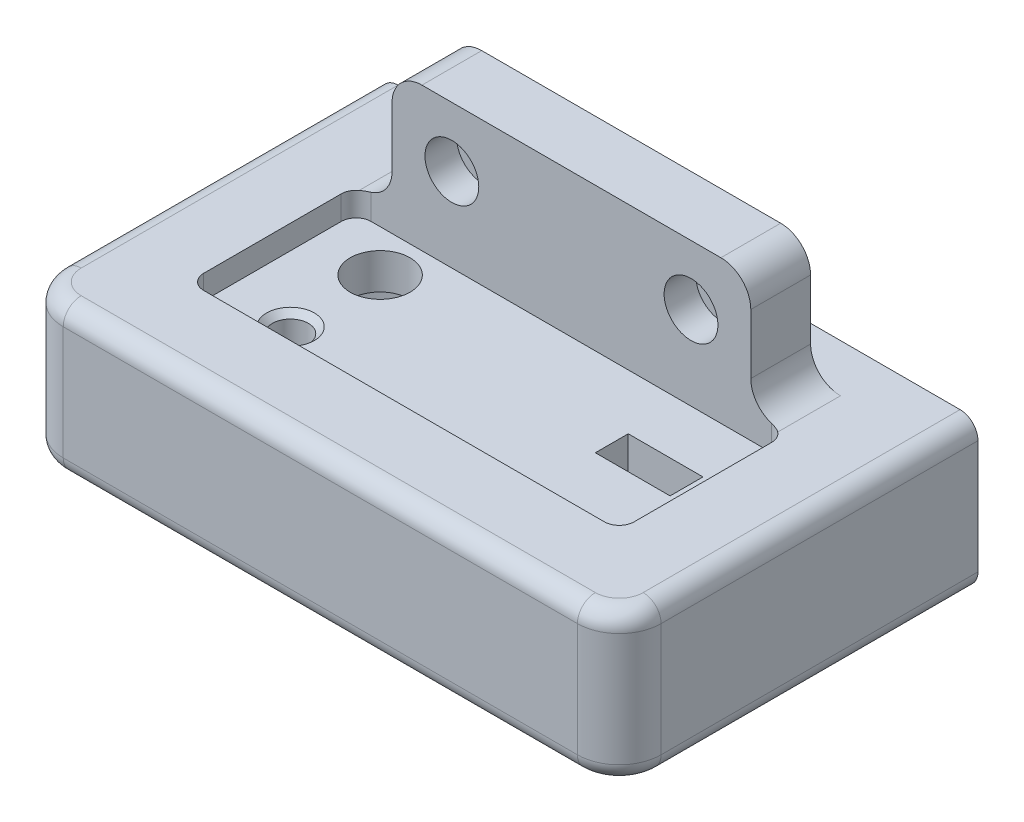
ISO-10303-21;
HEADER;
FILE_DESCRIPTION(('STEP AP214'),'2;1');
FILE_NAME('part.step','',(''),(''),'','','');
FILE_SCHEMA(('AUTOMOTIVE_DESIGN { 1 0 10303 214 1 1 1 1 }'));
ENDSEC;
DATA;
#1=APPLICATION_CONTEXT('core data for automotive mechanical design processes');
#2=APPLICATION_PROTOCOL_DEFINITION('international standard','automotive_design',2000,#1);
#3=PRODUCT_CONTEXT('',#1,'mechanical');
#4=PRODUCT('Part','Part','',(#3));
#5=PRODUCT_RELATED_PRODUCT_CATEGORY('part','',(#4));
#6=PRODUCT_DEFINITION_FORMATION('','',#4);
#7=PRODUCT_DEFINITION_CONTEXT('part definition',#1,'design');
#8=PRODUCT_DEFINITION('design','',#6,#7);
#9=PRODUCT_DEFINITION_SHAPE('','',#8);
#10=(LENGTH_UNIT() NAMED_UNIT(*) SI_UNIT(.MILLI.,.METRE.));
#11=(NAMED_UNIT(*) PLANE_ANGLE_UNIT() SI_UNIT($,.RADIAN.));
#12=(NAMED_UNIT(*) SI_UNIT($,.STERADIAN.) SOLID_ANGLE_UNIT());
#13=UNCERTAINTY_MEASURE_WITH_UNIT(LENGTH_MEASURE(1.E-05),#10,'distance_accuracy_value','');
#14=(GEOMETRIC_REPRESENTATION_CONTEXT(3) GLOBAL_UNCERTAINTY_ASSIGNED_CONTEXT((#13)) GLOBAL_UNIT_ASSIGNED_CONTEXT((#10,
#11,#12)) REPRESENTATION_CONTEXT('',''));
#15=CARTESIAN_POINT('',(0.,0.,0.));
#16=DIRECTION('',(0.,0.,1.));
#17=DIRECTION('',(1.,0.,0.));
#18=AXIS2_PLACEMENT_3D('',#15,#16,#17);
#19=CARTESIAN_POINT('',(25.,25.,25.));
#20=DIRECTION('',(0.,-1.,0.));
#21=DIRECTION('',(0.,0.,-1.));
#22=AXIS2_PLACEMENT_3D('',#19,#20,#21);
#23=CYLINDRICAL_SURFACE('',#22,5.);
#24=CARTESIAN_POINT('',(25.,15.,25.));
#25=DIRECTION('',(0.,-1.,0.));
#26=DIRECTION('',(0.,0.,1.));
#27=AXIS2_PLACEMENT_3D('',#24,#25,#26);
#28=CIRCLE('',#27,5.);
#29=CARTESIAN_POINT('',(25.,15.,30.));
#30=VERTEX_POINT('',#29);
#31=EDGE_CURVE('E325',#30,#30,#28,.T.);
#32=ORIENTED_EDGE('',*,*,#31,.T.);
#33=EDGE_LOOP('',(#32));
#34=FACE_BOUND('',#33,.T.);
#35=CARTESIAN_POINT('',(25.,21.,25.));
#36=DIRECTION('',(0.,1.,0.));
#37=DIRECTION('',(0.,0.,1.));
#38=AXIS2_PLACEMENT_3D('',#35,#36,#37);
#39=CIRCLE('',#38,5.);
#40=CARTESIAN_POINT('',(25.,21.,30.));
#41=VERTEX_POINT('',#40);
#42=EDGE_CURVE('E322',#41,#41,#39,.F.);
#43=ORIENTED_EDGE('',*,*,#42,.F.);
#44=EDGE_LOOP('',(#43));
#45=FACE_BOUND('',#44,.T.);
#46=ADVANCED_FACE('F37',(#34,#45),#23,.F.);
#47=CARTESIAN_POINT('',(25.,25.,40.));
#48=DIRECTION('',(0.,-1.,0.));
#49=DIRECTION('',(0.,0.,-1.));
#50=AXIS2_PLACEMENT_3D('',#47,#48,#49);
#51=CYLINDRICAL_SURFACE('',#50,3.00000000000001);
#52=CARTESIAN_POINT('',(25.,20.,40.));
#53=DIRECTION('',(0.,1.,0.));
#54=DIRECTION('',(0.,0.,1.));
#55=AXIS2_PLACEMENT_3D('',#52,#53,#54);
#56=CIRCLE('',#55,3.00000000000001);
#57=CARTESIAN_POINT('',(25.,20.,43.));
#58=VERTEX_POINT('',#57);
#59=EDGE_CURVE('E509',#58,#58,#56,.T.);
#60=ORIENTED_EDGE('',*,*,#59,.T.);
#61=EDGE_LOOP('',(#60));
#62=FACE_BOUND('',#61,.T.);
#63=CARTESIAN_POINT('',(25.,15.,40.));
#64=DIRECTION('',(0.,-1.,0.));
#65=DIRECTION('',(0.,0.,1.));
#66=AXIS2_PLACEMENT_3D('',#63,#64,#65);
#67=CIRCLE('',#66,3.00000000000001);
#68=CARTESIAN_POINT('',(25.,15.,43.));
#69=VERTEX_POINT('',#68);
#70=EDGE_CURVE('E330',#69,#69,#67,.T.);
#71=ORIENTED_EDGE('',*,*,#70,.T.);
#72=EDGE_LOOP('',(#71));
#73=FACE_BOUND('',#72,.T.);
#74=ADVANCED_FACE('F577',(#62,#73),#51,.F.);
#75=CARTESIAN_POINT('',(81.25,25.,27.25));
#76=DIRECTION('',(1.,0.,0.));
#77=DIRECTION('',(0.,0.,-1.));
#78=AXIS2_PLACEMENT_3D('',#75,#76,#77);
#79=PLANE('',#78);
#80=DIRECTION('',(0.,0.,1.));
#81=VECTOR('',#80,1.);
#82=CARTESIAN_POINT('',(81.25,21.,27.25));
#83=LINE('',#82,#81);
#84=CARTESIAN_POINT('',(81.25,21.,27.25));
#85=VERTEX_POINT('',#84);
#86=CARTESIAN_POINT('',(81.25,21.,32.75));
#87=VERTEX_POINT('',#86);
#88=EDGE_CURVE('E320',#85,#87,#83,.T.);
#89=ORIENTED_EDGE('',*,*,#88,.F.);
#90=DIRECTION('',(0.,-1.,0.));
#91=VECTOR('',#90,1.);
#92=CARTESIAN_POINT('',(81.25,25.,27.25));
#93=LINE('',#92,#91);
#94=CARTESIAN_POINT('',(81.25,15.,27.25));
#95=VERTEX_POINT('',#94);
#96=EDGE_CURVE('E340',#85,#95,#93,.T.);
#97=ORIENTED_EDGE('',*,*,#96,.T.);
#98=DIRECTION('',(0.,0.,1.));
#99=VECTOR('',#98,1.);
#100=CARTESIAN_POINT('',(81.25,15.,27.25));
#101=LINE('',#100,#99);
#102=CARTESIAN_POINT('',(81.25,15.,32.75));
#103=VERTEX_POINT('',#102);
#104=EDGE_CURVE('E326',#95,#103,#101,.T.);
#105=ORIENTED_EDGE('',*,*,#104,.T.);
#106=DIRECTION('',(0.,-1.,0.));
#107=VECTOR('',#106,1.);
#108=CARTESIAN_POINT('',(81.25,25.,32.75));
#109=LINE('',#108,#107);
#110=EDGE_CURVE('E339',#87,#103,#109,.T.);
#111=ORIENTED_EDGE('',*,*,#110,.F.);
#112=EDGE_LOOP('',(#89,#97,#105,#111));
#113=FACE_BOUND('',#112,.T.);
#114=ADVANCED_FACE('F583',(#113),#79,.F.);
#115=CARTESIAN_POINT('',(68.75,25.,27.25));
#116=DIRECTION('',(0.,0.,-1.));
#117=DIRECTION('',(-1.,0.,0.));
#118=AXIS2_PLACEMENT_3D('',#115,#116,#117);
#119=PLANE('',#118);
#120=DIRECTION('',(1.,0.,0.));
#121=VECTOR('',#120,1.);
#122=CARTESIAN_POINT('',(68.75,21.,27.25));
#123=LINE('',#122,#121);
#124=CARTESIAN_POINT('',(68.75,21.,27.25));
#125=VERTEX_POINT('',#124);
#126=EDGE_CURVE('E318',#125,#85,#123,.T.);
#127=ORIENTED_EDGE('',*,*,#126,.F.);
#128=DIRECTION('',(0.,-1.,0.));
#129=VECTOR('',#128,1.);
#130=CARTESIAN_POINT('',(68.75,25.,27.25));
#131=LINE('',#130,#129);
#132=CARTESIAN_POINT('',(68.75,15.,27.25));
#133=VERTEX_POINT('',#132);
#134=EDGE_CURVE('E343',#125,#133,#131,.T.);
#135=ORIENTED_EDGE('',*,*,#134,.T.);
#136=DIRECTION('',(1.,0.,0.));
#137=VECTOR('',#136,1.);
#138=CARTESIAN_POINT('',(68.75,15.,27.25));
#139=LINE('',#138,#137);
#140=EDGE_CURVE('E336',#133,#95,#139,.T.);
#141=ORIENTED_EDGE('',*,*,#140,.T.);
#142=ORIENTED_EDGE('',*,*,#96,.F.);
#143=EDGE_LOOP('',(#127,#135,#141,#142));
#144=FACE_BOUND('',#143,.T.);
#145=ADVANCED_FACE('F789',(#144),#119,.F.);
#146=CARTESIAN_POINT('',(68.75,25.,27.25));
#147=DIRECTION('',(-1.,0.,0.));
#148=DIRECTION('',(0.,0.,1.));
#149=AXIS2_PLACEMENT_3D('',#146,#147,#148);
#150=PLANE('',#149);
#151=DIRECTION('',(0.,0.,-1.));
#152=VECTOR('',#151,1.);
#153=CARTESIAN_POINT('',(68.75,21.,27.25));
#154=LINE('',#153,#152);
#155=CARTESIAN_POINT('',(68.75,21.,32.75));
#156=VERTEX_POINT('',#155);
#157=EDGE_CURVE('E306',#156,#125,#154,.T.);
#158=ORIENTED_EDGE('',*,*,#157,.F.);
#159=DIRECTION('',(0.,-1.,0.));
#160=VECTOR('',#159,1.);
#161=CARTESIAN_POINT('',(68.75,25.,32.75));
#162=LINE('',#161,#160);
#163=CARTESIAN_POINT('',(68.75,15.,32.75));
#164=VERTEX_POINT('',#163);
#165=EDGE_CURVE('E345',#156,#164,#162,.T.);
#166=ORIENTED_EDGE('',*,*,#165,.T.);
#167=DIRECTION('',(0.,0.,-1.));
#168=VECTOR('',#167,1.);
#169=CARTESIAN_POINT('',(68.75,15.,27.25));
#170=LINE('',#169,#168);
#171=EDGE_CURVE('E333',#164,#133,#170,.T.);
#172=ORIENTED_EDGE('',*,*,#171,.T.);
#173=ORIENTED_EDGE('',*,*,#134,.F.);
#174=EDGE_LOOP('',(#158,#166,#172,#173));
#175=FACE_BOUND('',#174,.T.);
#176=ADVANCED_FACE('F792',(#175),#150,.F.);
#177=CARTESIAN_POINT('',(68.75,25.,32.75));
#178=DIRECTION('',(0.,0.,1.));
#179=DIRECTION('',(1.,0.,0.));
#180=AXIS2_PLACEMENT_3D('',#177,#178,#179);
#181=PLANE('',#180);
#182=DIRECTION('',(-1.,0.,0.));
#183=VECTOR('',#182,1.);
#184=CARTESIAN_POINT('',(68.75,21.,32.75));
#185=LINE('',#184,#183);
#186=EDGE_CURVE('E479',#87,#156,#185,.T.);
#187=ORIENTED_EDGE('',*,*,#186,.F.);
#188=ORIENTED_EDGE('',*,*,#110,.T.);
#189=DIRECTION('',(-1.,0.,0.));
#190=VECTOR('',#189,1.);
#191=CARTESIAN_POINT('',(68.75,15.,32.75));
#192=LINE('',#191,#190);
#193=EDGE_CURVE('E329',#103,#164,#192,.T.);
#194=ORIENTED_EDGE('',*,*,#193,.T.);
#195=ORIENTED_EDGE('',*,*,#165,.F.);
#196=EDGE_LOOP('',(#187,#188,#194,#195));
#197=FACE_BOUND('',#196,.T.);
#198=ADVANCED_FACE('F640',(#197),#181,.F.);
#199=CARTESIAN_POINT('',(30.,35.,18.));
#200=DIRECTION('',(0.,0.,-1.));
#201=DIRECTION('',(-1.,0.,0.));
#202=AXIS2_PLACEMENT_3D('',#199,#200,#201);
#203=CYLINDRICAL_SURFACE('',#202,3.);
#204=CARTESIAN_POINT('',(30.,35.,8.));
#205=DIRECTION('',(0.,0.,-1.));
#206=DIRECTION('',(-1.,0.,0.));
#207=AXIS2_PLACEMENT_3D('',#204,#205,#206);
#208=CIRCLE('',#207,3.);
#209=CARTESIAN_POINT('',(27.,35.,8.));
#210=VERTEX_POINT('',#209);
#211=EDGE_CURVE('E381',#210,#210,#208,.T.);
#212=ORIENTED_EDGE('',*,*,#211,.T.);
#213=EDGE_LOOP('',(#212));
#214=FACE_BOUND('',#213,.T.);
#215=CARTESIAN_POINT('',(30.,35.,12.7));
#216=DIRECTION('',(0.,0.,1.));
#217=DIRECTION('',(1.,0.,0.));
#218=AXIS2_PLACEMENT_3D('',#215,#216,#217);
#219=CIRCLE('',#218,3.);
#220=CARTESIAN_POINT('',(33.,35.,12.7));
#221=VERTEX_POINT('',#220);
#222=EDGE_CURVE('E377',#221,#221,#219,.F.);
#223=ORIENTED_EDGE('',*,*,#222,.F.);
#224=EDGE_LOOP('',(#223));
#225=FACE_BOUND('',#224,.T.);
#226=ADVANCED_FACE('F636',(#214,#225),#203,.F.);
#227=CARTESIAN_POINT('',(70.,35.,18.));
#228=DIRECTION('',(0.,0.,-1.));
#229=DIRECTION('',(-1.,0.,0.));
#230=AXIS2_PLACEMENT_3D('',#227,#228,#229);
#231=CYLINDRICAL_SURFACE('',#230,3.00000000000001);
#232=CARTESIAN_POINT('',(70.,35.,8.));
#233=DIRECTION('',(0.,0.,-1.));
#234=DIRECTION('',(-1.,0.,0.));
#235=AXIS2_PLACEMENT_3D('',#232,#233,#234);
#236=CIRCLE('',#235,3.00000000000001);
#237=CARTESIAN_POINT('',(67.,35.,8.));
#238=VERTEX_POINT('',#237);
#239=EDGE_CURVE('E386',#238,#238,#236,.T.);
#240=ORIENTED_EDGE('',*,*,#239,.T.);
#241=EDGE_LOOP('',(#240));
#242=FACE_BOUND('',#241,.T.);
#243=CARTESIAN_POINT('',(70.,35.,12.7));
#244=DIRECTION('',(0.,0.,1.));
#245=DIRECTION('',(1.,0.,0.));
#246=AXIS2_PLACEMENT_3D('',#243,#244,#245);
#247=CIRCLE('',#246,3.00000000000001);
#248=CARTESIAN_POINT('',(73.,35.,12.7));
#249=VERTEX_POINT('',#248);
#250=EDGE_CURVE('E355',#249,#249,#247,.F.);
#251=ORIENTED_EDGE('',*,*,#250,.F.);
#252=EDGE_LOOP('',(#251));
#253=FACE_BOUND('',#252,.T.);
#254=ADVANCED_FACE('F632',(#242,#253),#231,.F.);
#255=CARTESIAN_POINT('',(100.,0.,60.));
#256=DIRECTION('',(-1.,0.,0.));
#257=DIRECTION('',(0.,0.,1.));
#258=AXIS2_PLACEMENT_3D('',#255,#256,#257);
#259=PLANE('',#258);
#260=DIRECTION('',(0.,1.,0.));
#261=VECTOR('',#260,1.);
#262=CARTESIAN_POINT('',(100.,0.,0.));
#263=LINE('',#262,#261);
#264=CARTESIAN_POINT('',(100.,3.,0.));
#265=VERTEX_POINT('',#264);
#266=CARTESIAN_POINT('',(100.,22.,0.));
#267=VERTEX_POINT('',#266);
#268=EDGE_CURVE('E417',#265,#267,#263,.T.);
#269=ORIENTED_EDGE('',*,*,#268,.T.);
#270=DIRECTION('',(0.,0.,-1.));
#271=VECTOR('',#270,1.);
#272=CARTESIAN_POINT('',(100.,22.,60.));
#273=LINE('',#272,#271);
#274=CARTESIAN_POINT('',(100.,22.,53.));
#275=VERTEX_POINT('',#274);
#276=EDGE_CURVE('E450',#267,#275,#273,.F.);
#277=ORIENTED_EDGE('',*,*,#276,.T.);
#278=DIRECTION('',(0.,-1.,0.));
#279=VECTOR('',#278,1.);
#280=CARTESIAN_POINT('',(100.,45.,53.));
#281=LINE('',#280,#279);
#282=CARTESIAN_POINT('',(100.,3.00000000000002,53.));
#283=VERTEX_POINT('',#282);
#284=EDGE_CURVE('E382',#275,#283,#281,.T.);
#285=ORIENTED_EDGE('',*,*,#284,.T.);
#286=DIRECTION('',(0.,0.,-1.));
#287=VECTOR('',#286,1.);
#288=CARTESIAN_POINT('',(100.,3.,60.));
#289=LINE('',#288,#287);
#290=EDGE_CURVE('E448',#283,#265,#289,.T.);
#291=ORIENTED_EDGE('',*,*,#290,.T.);
#292=EDGE_LOOP('',(#269,#277,#285,#291));
#293=FACE_BOUND('',#292,.T.);
#294=ADVANCED_FACE('F635',(#293),#259,.F.);
#295=CARTESIAN_POINT('',(0.,0.,60.));
#296=DIRECTION('',(0.,0.,-1.));
#297=DIRECTION('',(-1.,0.,0.));
#298=AXIS2_PLACEMENT_3D('',#295,#296,#297);
#299=PLANE('',#298);
#300=DIRECTION('',(0.,-1.,0.));
#301=VECTOR('',#300,1.);
#302=CARTESIAN_POINT('',(93.,45.,60.));
#303=LINE('',#302,#301);
#304=CARTESIAN_POINT('',(93.,3.00000000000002,60.));
#305=VERTEX_POINT('',#304);
#306=CARTESIAN_POINT('',(93.,22.,60.));
#307=VERTEX_POINT('',#306);
#308=EDGE_CURVE('E423',#305,#307,#303,.F.);
#309=ORIENTED_EDGE('',*,*,#308,.T.);
#310=DIRECTION('',(-1.,0.,0.));
#311=VECTOR('',#310,1.);
#312=CARTESIAN_POINT('',(0.,22.,60.));
#313=LINE('',#312,#311);
#314=CARTESIAN_POINT('',(7.,22.,60.));
#315=VERTEX_POINT('',#314);
#316=EDGE_CURVE('E458',#307,#315,#313,.T.);
#317=ORIENTED_EDGE('',*,*,#316,.T.);
#318=DIRECTION('',(0.,-1.,0.));
#319=VECTOR('',#318,1.);
#320=CARTESIAN_POINT('',(7.,45.,60.));
#321=LINE('',#320,#319);
#322=CARTESIAN_POINT('',(7.,3.00000000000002,60.));
#323=VERTEX_POINT('',#322);
#324=EDGE_CURVE('E426',#323,#315,#321,.F.);
#325=ORIENTED_EDGE('',*,*,#324,.F.);
#326=DIRECTION('',(1.,0.,0.));
#327=VECTOR('',#326,1.);
#328=CARTESIAN_POINT('',(0.,3.,60.));
#329=LINE('',#328,#327);
#330=EDGE_CURVE('E456',#323,#305,#329,.T.);
#331=ORIENTED_EDGE('',*,*,#330,.T.);
#332=EDGE_LOOP('',(#309,#317,#325,#331));
#333=FACE_BOUND('',#332,.T.);
#334=ADVANCED_FACE('F662',(#333),#299,.F.);
#335=CARTESIAN_POINT('',(0.,25.,60.));
#336=DIRECTION('',(0.,-1.,0.));
#337=DIRECTION('',(0.,0.,-1.));
#338=AXIS2_PLACEMENT_3D('',#335,#336,#337);
#339=PLANE('',#338);
#340=CARTESIAN_POINT('',(93.,25.,53.));
#341=DIRECTION('',(0.,-1.,0.));
#342=DIRECTION('',(0.,0.,-1.));
#343=AXIS2_PLACEMENT_3D('',#340,#341,#342);
#344=CIRCLE('',#343,4.00000000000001);
#345=CARTESIAN_POINT('',(93.,25.,57.));
#346=VERTEX_POINT('',#345);
#347=CARTESIAN_POINT('',(97.,25.,53.));
#348=VERTEX_POINT('',#347);
#349=EDGE_CURVE('E435',#346,#348,#344,.F.);
#350=ORIENTED_EDGE('',*,*,#349,.T.);
#351=DIRECTION('',(0.,0.,-1.));
#352=VECTOR('',#351,1.);
#353=CARTESIAN_POINT('',(97.,25.,60.));
#354=LINE('',#353,#352);
#355=CARTESIAN_POINT('',(97.,25.,0.));
#356=VERTEX_POINT('',#355);
#357=EDGE_CURVE('E437',#348,#356,#354,.T.);
#358=ORIENTED_EDGE('',*,*,#357,.T.);
#359=DIRECTION('',(-1.,0.,0.));
#360=VECTOR('',#359,1.);
#361=CARTESIAN_POINT('',(0.,25.,0.));
#362=LINE('',#361,#360);
#363=CARTESIAN_POINT('',(3.,25.,0.));
#364=VERTEX_POINT('',#363);
#365=EDGE_CURVE('E420',#356,#364,#362,.T.);
#366=ORIENTED_EDGE('',*,*,#365,.T.);
#367=DIRECTION('',(0.,0.,-1.));
#368=VECTOR('',#367,1.);
#369=CARTESIAN_POINT('',(3.,25.,60.));
#370=LINE('',#369,#368);
#371=CARTESIAN_POINT('',(3.,25.,53.));
#372=VERTEX_POINT('',#371);
#373=EDGE_CURVE('E429',#364,#372,#370,.F.);
#374=ORIENTED_EDGE('',*,*,#373,.T.);
#375=CARTESIAN_POINT('',(7.,25.,53.));
#376=DIRECTION('',(0.,-1.,0.));
#377=DIRECTION('',(0.,0.,-1.));
#378=AXIS2_PLACEMENT_3D('',#375,#376,#377);
#379=CIRCLE('',#378,4.);
#380=CARTESIAN_POINT('',(7.,25.,57.));
#381=VERTEX_POINT('',#380);
#382=EDGE_CURVE('E431',#372,#381,#379,.F.);
#383=ORIENTED_EDGE('',*,*,#382,.T.);
#384=DIRECTION('',(-1.,0.,0.));
#385=VECTOR('',#384,1.);
#386=CARTESIAN_POINT('',(0.,25.,57.));
#387=LINE('',#386,#385);
#388=EDGE_CURVE('E433',#381,#346,#387,.F.);
#389=ORIENTED_EDGE('',*,*,#388,.T.);
#390=EDGE_LOOP('',(#350,#358,#366,#374,#383,#389));
#391=FACE_BOUND('',#390,.T.);
#392=CARTESIAN_POINT('',(16.5,25.,20.5));
#393=DIRECTION('',(0.,1.,0.));
#394=DIRECTION('',(0.,0.,-1.));
#395=AXIS2_PLACEMENT_3D('',#392,#393,#394);
#396=CIRCLE('',#395,2.5);
#397=CARTESIAN_POINT('',(15.,25.,18.5));
#398=VERTEX_POINT('',#397);
#399=CARTESIAN_POINT('',(14.,25.,20.5));
#400=VERTEX_POINT('',#399);
#401=EDGE_CURVE('E297',#398,#400,#396,.T.);
#402=ORIENTED_EDGE('',*,*,#401,.F.);
#403=DIRECTION('',(0.,0.,1.));
#404=VECTOR('',#403,1.);
#405=CARTESIAN_POINT('',(15.,25.,8.));
#406=LINE('',#405,#404);
#407=CARTESIAN_POINT('',(15.,25.,8.));
#408=VERTEX_POINT('',#407);
#409=EDGE_CURVE('E519',#398,#408,#406,.F.);
#410=ORIENTED_EDGE('',*,*,#409,.T.);
#411=DIRECTION('',(-1.,0.,0.));
#412=VECTOR('',#411,1.);
#413=CARTESIAN_POINT('',(20.,25.,8.));
#414=LINE('',#413,#412);
#415=CARTESIAN_POINT('',(85.,25.,8.));
#416=VERTEX_POINT('',#415);
#417=EDGE_CURVE('E389',#416,#408,#414,.T.);
#418=ORIENTED_EDGE('',*,*,#417,.F.);
#419=DIRECTION('',(0.,0.,-1.));
#420=VECTOR('',#419,1.);
#421=CARTESIAN_POINT('',(85.,25.,18.));
#422=LINE('',#421,#420);
#423=CARTESIAN_POINT('',(85.,25.,18.5));
#424=VERTEX_POINT('',#423);
#425=EDGE_CURVE('E517',#416,#424,#422,.F.);
#426=ORIENTED_EDGE('',*,*,#425,.T.);
#427=CARTESIAN_POINT('',(83.5,25.,20.5));
#428=DIRECTION('',(0.,1.,0.));
#429=DIRECTION('',(0.,0.,-1.));
#430=AXIS2_PLACEMENT_3D('',#427,#428,#429);
#431=CIRCLE('',#430,2.5);
#432=CARTESIAN_POINT('',(86.,25.,20.5));
#433=VERTEX_POINT('',#432);
#434=EDGE_CURVE('E294',#433,#424,#431,.T.);
#435=ORIENTED_EDGE('',*,*,#434,.F.);
#436=DIRECTION('',(0.,0.,-1.));
#437=VECTOR('',#436,1.);
#438=CARTESIAN_POINT('',(86.,25.,43.5));
#439=LINE('',#438,#437);
#440=CARTESIAN_POINT('',(86.,25.,43.5));
#441=VERTEX_POINT('',#440);
#442=EDGE_CURVE('E292',#441,#433,#439,.T.);
#443=ORIENTED_EDGE('',*,*,#442,.F.);
#444=CARTESIAN_POINT('',(83.5,25.,43.5));
#445=DIRECTION('',(0.,1.,0.));
#446=DIRECTION('',(0.,0.,1.));
#447=AXIS2_PLACEMENT_3D('',#444,#445,#446);
#448=CIRCLE('',#447,2.5);
#449=CARTESIAN_POINT('',(83.5,25.,46.));
#450=VERTEX_POINT('',#449);
#451=EDGE_CURVE('E253',#450,#441,#448,.T.);
#452=ORIENTED_EDGE('',*,*,#451,.F.);
#453=DIRECTION('',(1.,0.,0.));
#454=VECTOR('',#453,1.);
#455=CARTESIAN_POINT('',(16.5,25.,46.));
#456=LINE('',#455,#454);
#457=CARTESIAN_POINT('',(16.5,25.,46.));
#458=VERTEX_POINT('',#457);
#459=EDGE_CURVE('E272',#458,#450,#456,.T.);
#460=ORIENTED_EDGE('',*,*,#459,.F.);
#461=CARTESIAN_POINT('',(16.5,25.,43.5));
#462=DIRECTION('',(0.,1.,0.));
#463=DIRECTION('',(0.,0.,-1.));
#464=AXIS2_PLACEMENT_3D('',#461,#462,#463);
#465=CIRCLE('',#464,2.5);
#466=CARTESIAN_POINT('',(14.,25.,43.5));
#467=VERTEX_POINT('',#466);
#468=EDGE_CURVE('E275',#467,#458,#465,.T.);
#469=ORIENTED_EDGE('',*,*,#468,.F.);
#470=DIRECTION('',(0.,0.,1.));
#471=VECTOR('',#470,1.);
#472=CARTESIAN_POINT('',(14.,25.,43.5));
#473=LINE('',#472,#471);
#474=EDGE_CURVE('E299',#400,#467,#473,.T.);
#475=ORIENTED_EDGE('',*,*,#474,.F.);
#476=EDGE_LOOP('',(#402,#410,#418,#426,#435,#443,#452,#460,#469,#475));
#477=FACE_BOUND('',#476,.T.);
#478=ADVANCED_FACE('F665',(#391,#477),#339,.F.);
#479=CARTESIAN_POINT('',(0.,0.,60.));
#480=DIRECTION('',(1.,0.,0.));
#481=DIRECTION('',(0.,0.,-1.));
#482=AXIS2_PLACEMENT_3D('',#479,#480,#481);
#483=PLANE('',#482);
#484=DIRECTION('',(0.,-1.,0.));
#485=VECTOR('',#484,1.);
#486=CARTESIAN_POINT('',(0.,45.,53.));
#487=LINE('',#486,#485);
#488=CARTESIAN_POINT('',(0.,22.,53.));
#489=VERTEX_POINT('',#488);
#490=CARTESIAN_POINT('',(0.,3.00000000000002,53.));
#491=VERTEX_POINT('',#490);
#492=EDGE_CURVE('E378',#489,#491,#487,.T.);
#493=ORIENTED_EDGE('',*,*,#492,.F.);
#494=DIRECTION('',(0.,0.,-1.));
#495=VECTOR('',#494,1.);
#496=CARTESIAN_POINT('',(0.,22.,60.));
#497=LINE('',#496,#495);
#498=CARTESIAN_POINT('',(0.,22.,0.));
#499=VERTEX_POINT('',#498);
#500=EDGE_CURVE('E467',#489,#499,#497,.T.);
#501=ORIENTED_EDGE('',*,*,#500,.T.);
#502=DIRECTION('',(0.,-1.,0.));
#503=VECTOR('',#502,1.);
#504=CARTESIAN_POINT('',(0.,0.,0.));
#505=LINE('',#504,#503);
#506=CARTESIAN_POINT('',(0.,3.,0.));
#507=VERTEX_POINT('',#506);
#508=EDGE_CURVE('E411',#499,#507,#505,.T.);
#509=ORIENTED_EDGE('',*,*,#508,.T.);
#510=DIRECTION('',(0.,0.,-1.));
#511=VECTOR('',#510,1.);
#512=CARTESIAN_POINT('',(0.,3.,60.));
#513=LINE('',#512,#511);
#514=EDGE_CURVE('E465',#507,#491,#513,.F.);
#515=ORIENTED_EDGE('',*,*,#514,.T.);
#516=EDGE_LOOP('',(#493,#501,#509,#515));
#517=FACE_BOUND('',#516,.T.);
#518=ADVANCED_FACE('F673',(#517),#483,.F.);
#519=CARTESIAN_POINT('',(0.,0.,60.));
#520=DIRECTION('',(0.,1.,0.));
#521=DIRECTION('',(0.,0.,1.));
#522=AXIS2_PLACEMENT_3D('',#519,#520,#521);
#523=PLANE('',#522);
#524=CARTESIAN_POINT('',(25.,0.,30.));
#525=DIRECTION('',(0.,-1.,0.));
#526=DIRECTION('',(0.,0.,-1.));
#527=AXIS2_PLACEMENT_3D('',#524,#525,#526);
#528=CIRCLE('',#527,20.);
#529=CARTESIAN_POINT('',(25.,0.,9.99999999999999));
#530=VERTEX_POINT('',#529);
#531=EDGE_CURVE('E368',#530,#530,#528,.T.);
#532=ORIENTED_EDGE('',*,*,#531,.F.);
#533=EDGE_LOOP('',(#532));
#534=FACE_BOUND('',#533,.T.);
#535=CARTESIAN_POINT('',(75.,0.,30.));
#536=DIRECTION('',(0.,-1.,0.));
#537=DIRECTION('',(0.,0.,-1.));
#538=AXIS2_PLACEMENT_3D('',#535,#536,#537);
#539=CIRCLE('',#538,20.);
#540=CARTESIAN_POINT('',(75.,0.,9.99999999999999));
#541=VERTEX_POINT('',#540);
#542=EDGE_CURVE('E374',#541,#541,#539,.T.);
#543=ORIENTED_EDGE('',*,*,#542,.F.);
#544=EDGE_LOOP('',(#543));
#545=FACE_BOUND('',#544,.T.);
#546=CARTESIAN_POINT('',(7.,0.,53.));
#547=DIRECTION('',(0.,1.,0.));
#548=DIRECTION('',(0.,0.,1.));
#549=AXIS2_PLACEMENT_3D('',#546,#547,#548);
#550=CIRCLE('',#549,4.);
#551=CARTESIAN_POINT('',(7.,0.,57.));
#552=VERTEX_POINT('',#551);
#553=CARTESIAN_POINT('',(3.,0.,53.));
#554=VERTEX_POINT('',#553);
#555=EDGE_CURVE('E475',#552,#554,#550,.F.);
#556=ORIENTED_EDGE('',*,*,#555,.T.);
#557=DIRECTION('',(0.,0.,-1.));
#558=VECTOR('',#557,1.);
#559=CARTESIAN_POINT('',(3.,0.,60.));
#560=LINE('',#559,#558);
#561=CARTESIAN_POINT('',(3.,0.,0.));
#562=VERTEX_POINT('',#561);
#563=EDGE_CURVE('E477',#554,#562,#560,.T.);
#564=ORIENTED_EDGE('',*,*,#563,.T.);
#565=DIRECTION('',(1.,0.,0.));
#566=VECTOR('',#565,1.);
#567=CARTESIAN_POINT('',(0.,0.,0.));
#568=LINE('',#567,#566);
#569=CARTESIAN_POINT('',(97.,0.,0.));
#570=VERTEX_POINT('',#569);
#571=EDGE_CURVE('E414',#562,#570,#568,.T.);
#572=ORIENTED_EDGE('',*,*,#571,.T.);
#573=DIRECTION('',(0.,0.,-1.));
#574=VECTOR('',#573,1.);
#575=CARTESIAN_POINT('',(97.,0.,60.));
#576=LINE('',#575,#574);
#577=CARTESIAN_POINT('',(97.,0.,53.));
#578=VERTEX_POINT('',#577);
#579=EDGE_CURVE('E469',#570,#578,#576,.F.);
#580=ORIENTED_EDGE('',*,*,#579,.T.);
#581=CARTESIAN_POINT('',(93.,0.,53.));
#582=DIRECTION('',(0.,1.,0.));
#583=DIRECTION('',(0.,0.,1.));
#584=AXIS2_PLACEMENT_3D('',#581,#582,#583);
#585=CIRCLE('',#584,4.00000000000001);
#586=CARTESIAN_POINT('',(93.,0.,57.));
#587=VERTEX_POINT('',#586);
#588=EDGE_CURVE('E471',#578,#587,#585,.F.);
#589=ORIENTED_EDGE('',*,*,#588,.T.);
#590=DIRECTION('',(1.,0.,0.));
#591=VECTOR('',#590,1.);
#592=CARTESIAN_POINT('',(0.,0.,57.));
#593=LINE('',#592,#591);
#594=EDGE_CURVE('E473',#587,#552,#593,.F.);
#595=ORIENTED_EDGE('',*,*,#594,.T.);
#596=EDGE_LOOP('',(#556,#564,#572,#580,#589,#595));
#597=FACE_BOUND('',#596,.T.);
#598=ADVANCED_FACE('F669',(#534,#545,#597),#523,.F.);
#599=CARTESIAN_POINT('',(0.,0.,0.));
#600=DIRECTION('',(0.,0.,-1.));
#601=DIRECTION('',(-1.,0.,0.));
#602=AXIS2_PLACEMENT_3D('',#599,#600,#601);
#603=PLANE('',#602);
#604=ORIENTED_EDGE('',*,*,#365,.F.);
#605=CARTESIAN_POINT('',(97.,22.,0.));
#606=DIRECTION('',(0.,0.,-1.));
#607=DIRECTION('',(-1.,0.,0.));
#608=AXIS2_PLACEMENT_3D('',#605,#606,#607);
#609=CIRCLE('',#608,3.);
#610=EDGE_CURVE('E446',#356,#267,#609,.T.);
#611=ORIENTED_EDGE('',*,*,#610,.T.);
#612=ORIENTED_EDGE('',*,*,#268,.F.);
#613=CARTESIAN_POINT('',(97.,3.,0.));
#614=DIRECTION('',(0.,0.,-1.));
#615=DIRECTION('',(-1.,0.,0.));
#616=AXIS2_PLACEMENT_3D('',#613,#614,#615);
#617=CIRCLE('',#616,3.);
#618=EDGE_CURVE('E440',#265,#570,#617,.T.);
#619=ORIENTED_EDGE('',*,*,#618,.T.);
#620=ORIENTED_EDGE('',*,*,#571,.F.);
#621=CARTESIAN_POINT('',(3.,3.,0.));
#622=DIRECTION('',(0.,0.,-1.));
#623=DIRECTION('',(-1.,0.,0.));
#624=AXIS2_PLACEMENT_3D('',#621,#622,#623);
#625=CIRCLE('',#624,3.);
#626=EDGE_CURVE('E442',#562,#507,#625,.T.);
#627=ORIENTED_EDGE('',*,*,#626,.T.);
#628=ORIENTED_EDGE('',*,*,#508,.F.);
#629=CARTESIAN_POINT('',(3.,22.,0.));
#630=DIRECTION('',(0.,0.,-1.));
#631=DIRECTION('',(-1.,0.,0.));
#632=AXIS2_PLACEMENT_3D('',#629,#630,#631);
#633=CIRCLE('',#632,3.);
#634=EDGE_CURVE('E444',#499,#364,#633,.T.);
#635=ORIENTED_EDGE('',*,*,#634,.T.);
#636=EDGE_LOOP('',(#604,#611,#612,#619,#620,#627,#628,#635));
#637=FACE_BOUND('',#636,.T.);
#638=ADVANCED_FACE('F660',(#637),#603,.T.);
#639=CARTESIAN_POINT('',(20.,45.,8.));
#640=DIRECTION('',(1.,0.,0.));
#641=DIRECTION('',(0.,0.,-1.));
#642=AXIS2_PLACEMENT_3D('',#639,#640,#641);
#643=PLANE('',#642);
#644=DIRECTION('',(0.,-1.,0.));
#645=VECTOR('',#644,1.);
#646=CARTESIAN_POINT('',(20.,45.,8.));
#647=LINE('',#646,#645);
#648=CARTESIAN_POINT('',(20.,40.,8.));
#649=VERTEX_POINT('',#648);
#650=CARTESIAN_POINT('',(20.,30.,8.));
#651=VERTEX_POINT('',#650);
#652=EDGE_CURVE('E398',#649,#651,#647,.T.);
#653=ORIENTED_EDGE('',*,*,#652,.T.);
#654=DIRECTION('',(0.,0.,1.));
#655=VECTOR('',#654,1.);
#656=CARTESIAN_POINT('',(20.,30.,18.));
#657=LINE('',#656,#655);
#658=CARTESIAN_POINT('',(20.,30.,18.));
#659=VERTEX_POINT('',#658);
#660=EDGE_CURVE('E514',#651,#659,#657,.T.);
#661=ORIENTED_EDGE('',*,*,#660,.T.);
#662=DIRECTION('',(0.,-1.,0.));
#663=VECTOR('',#662,1.);
#664=CARTESIAN_POINT('',(20.,45.,18.));
#665=LINE('',#664,#663);
#666=CARTESIAN_POINT('',(20.,40.,18.));
#667=VERTEX_POINT('',#666);
#668=EDGE_CURVE('E408',#667,#659,#665,.T.);
#669=ORIENTED_EDGE('',*,*,#668,.F.);
#670=DIRECTION('',(0.,0.,1.));
#671=VECTOR('',#670,1.);
#672=CARTESIAN_POINT('',(20.,40.,8.));
#673=LINE('',#672,#671);
#674=EDGE_CURVE('E512',#667,#649,#673,.F.);
#675=ORIENTED_EDGE('',*,*,#674,.T.);
#676=EDGE_LOOP('',(#653,#661,#669,#675));
#677=FACE_BOUND('',#676,.T.);
#678=ADVANCED_FACE('F656',(#677),#643,.F.);
#679=CARTESIAN_POINT('',(20.,45.,18.));
#680=DIRECTION('',(0.,0.,-1.));
#681=DIRECTION('',(-1.,0.,0.));
#682=AXIS2_PLACEMENT_3D('',#679,#680,#681);
#683=PLANE('',#682);
#684=CARTESIAN_POINT('',(30.,35.,18.));
#685=DIRECTION('',(0.,0.,1.));
#686=DIRECTION('',(1.,0.,0.));
#687=AXIS2_PLACEMENT_3D('',#684,#685,#686);
#688=CIRCLE('',#687,4.5);
#689=CARTESIAN_POINT('',(34.5,35.,18.));
#690=VERTEX_POINT('',#689);
#691=EDGE_CURVE('E356',#690,#690,#688,.T.);
#692=ORIENTED_EDGE('',*,*,#691,.F.);
#693=EDGE_LOOP('',(#692));
#694=FACE_BOUND('',#693,.T.);
#695=CARTESIAN_POINT('',(70.,35.,18.));
#696=DIRECTION('',(0.,0.,1.));
#697=DIRECTION('',(1.,0.,0.));
#698=AXIS2_PLACEMENT_3D('',#695,#696,#697);
#699=CIRCLE('',#698,4.50000000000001);
#700=CARTESIAN_POINT('',(74.5,35.,18.));
#701=VERTEX_POINT('',#700);
#702=EDGE_CURVE('E342',#701,#701,#699,.T.);
#703=ORIENTED_EDGE('',*,*,#702,.F.);
#704=EDGE_LOOP('',(#703));
#705=FACE_BOUND('',#704,.T.);
#706=DIRECTION('',(1.,0.,0.));
#707=VECTOR('',#706,1.);
#708=CARTESIAN_POINT('',(20.,45.,18.));
#709=LINE('',#708,#707);
#710=CARTESIAN_POINT('',(25.,45.,18.));
#711=VERTEX_POINT('',#710);
#712=CARTESIAN_POINT('',(75.,45.,18.));
#713=VERTEX_POINT('',#712);
#714=EDGE_CURVE('E392',#711,#713,#709,.T.);
#715=ORIENTED_EDGE('',*,*,#714,.F.);
#716=CARTESIAN_POINT('',(25.,40.,18.));
#717=DIRECTION('',(0.,0.,-1.));
#718=DIRECTION('',(-1.,0.,0.));
#719=AXIS2_PLACEMENT_3D('',#716,#717,#718);
#720=CIRCLE('',#719,5.);
#721=EDGE_CURVE('E530',#711,#667,#720,.F.);
#722=ORIENTED_EDGE('',*,*,#721,.T.);
#723=ORIENTED_EDGE('',*,*,#668,.T.);
#724=CARTESIAN_POINT('',(15.,30.,18.));
#725=DIRECTION('',(0.,0.,-1.));
#726=DIRECTION('',(-1.,0.,0.));
#727=AXIS2_PLACEMENT_3D('',#724,#725,#726);
#728=CIRCLE('',#727,5.);
#729=CARTESIAN_POINT('',(16.5,25.2303039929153,18.));
#730=VERTEX_POINT('',#729);
#731=EDGE_CURVE('E541',#659,#730,#728,.T.);
#732=ORIENTED_EDGE('',*,*,#731,.T.);
#733=DIRECTION('',(0.,1.,0.));
#734=VECTOR('',#733,1.);
#735=CARTESIAN_POINT('',(16.5,21.,18.));
#736=LINE('',#735,#734);
#737=CARTESIAN_POINT('',(16.5,21.,18.));
#738=VERTEX_POINT('',#737);
#739=EDGE_CURVE('E60',#738,#730,#736,.T.);
#740=ORIENTED_EDGE('',*,*,#739,.F.);
#741=DIRECTION('',(-1.,0.,0.));
#742=VECTOR('',#741,1.);
#743=CARTESIAN_POINT('',(16.5,21.,18.));
#744=LINE('',#743,#742);
#745=CARTESIAN_POINT('',(83.5,21.,18.));
#746=VERTEX_POINT('',#745);
#747=EDGE_CURVE('E279',#746,#738,#744,.T.);
#748=ORIENTED_EDGE('',*,*,#747,.F.);
#749=DIRECTION('',(0.,1.,0.));
#750=VECTOR('',#749,1.);
#751=CARTESIAN_POINT('',(83.5,21.,18.));
#752=LINE('',#751,#750);
#753=CARTESIAN_POINT('',(83.5,25.2303039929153,18.));
#754=VERTEX_POINT('',#753);
#755=EDGE_CURVE('E52',#746,#754,#752,.T.);
#756=ORIENTED_EDGE('',*,*,#755,.T.);
#757=CARTESIAN_POINT('',(85.,30.,18.));
#758=DIRECTION('',(0.,0.,-1.));
#759=DIRECTION('',(-1.,0.,0.));
#760=AXIS2_PLACEMENT_3D('',#757,#758,#759);
#761=CIRCLE('',#760,5.);
#762=CARTESIAN_POINT('',(80.,30.,18.));
#763=VERTEX_POINT('',#762);
#764=EDGE_CURVE('E11',#754,#763,#761,.T.);
#765=ORIENTED_EDGE('',*,*,#764,.T.);
#766=DIRECTION('',(0.,-1.,0.));
#767=VECTOR('',#766,1.);
#768=CARTESIAN_POINT('',(80.,45.,18.));
#769=LINE('',#768,#767);
#770=CARTESIAN_POINT('',(80.,40.,18.));
#771=VERTEX_POINT('',#770);
#772=EDGE_CURVE('E405',#771,#763,#769,.T.);
#773=ORIENTED_EDGE('',*,*,#772,.F.);
#774=CARTESIAN_POINT('',(75.,40.,18.));
#775=DIRECTION('',(0.,0.,-1.));
#776=DIRECTION('',(-1.,0.,0.));
#777=AXIS2_PLACEMENT_3D('',#774,#775,#776);
#778=CIRCLE('',#777,5.);
#779=EDGE_CURVE('E528',#771,#713,#778,.F.);
#780=ORIENTED_EDGE('',*,*,#779,.T.);
#781=EDGE_LOOP('',(#715,#722,#723,#732,#740,#748,#756,#765,#773,#780));
#782=FACE_BOUND('',#781,.T.);
#783=ADVANCED_FACE('F652',(#694,#705,#782),#683,.F.);
#784=CARTESIAN_POINT('',(80.,45.,8.));
#785=DIRECTION('',(-1.,0.,0.));
#786=DIRECTION('',(0.,0.,1.));
#787=AXIS2_PLACEMENT_3D('',#784,#785,#786);
#788=PLANE('',#787);
#789=DIRECTION('',(0.,-1.,0.));
#790=VECTOR('',#789,1.);
#791=CARTESIAN_POINT('',(80.,45.,8.));
#792=LINE('',#791,#790);
#793=CARTESIAN_POINT('',(80.,40.,8.));
#794=VERTEX_POINT('',#793);
#795=CARTESIAN_POINT('',(80.,30.,8.));
#796=VERTEX_POINT('',#795);
#797=EDGE_CURVE('E402',#794,#796,#792,.T.);
#798=ORIENTED_EDGE('',*,*,#797,.F.);
#799=DIRECTION('',(0.,0.,-1.));
#800=VECTOR('',#799,1.);
#801=CARTESIAN_POINT('',(80.,40.,18.));
#802=LINE('',#801,#800);
#803=EDGE_CURVE('E539',#794,#771,#802,.F.);
#804=ORIENTED_EDGE('',*,*,#803,.T.);
#805=ORIENTED_EDGE('',*,*,#772,.T.);
#806=DIRECTION('',(0.,0.,-1.));
#807=VECTOR('',#806,1.);
#808=CARTESIAN_POINT('',(80.,30.,8.));
#809=LINE('',#808,#807);
#810=EDGE_CURVE('E536',#763,#796,#809,.T.);
#811=ORIENTED_EDGE('',*,*,#810,.T.);
#812=EDGE_LOOP('',(#798,#804,#805,#811));
#813=FACE_BOUND('',#812,.T.);
#814=ADVANCED_FACE('F648',(#813),#788,.F.);
#815=CARTESIAN_POINT('',(20.,45.,8.));
#816=DIRECTION('',(0.,0.,1.));
#817=DIRECTION('',(1.,0.,0.));
#818=AXIS2_PLACEMENT_3D('',#815,#816,#817);
#819=PLANE('',#818);
#820=ORIENTED_EDGE('',*,*,#239,.F.);
#821=EDGE_LOOP('',(#820));
#822=FACE_BOUND('',#821,.T.);
#823=ORIENTED_EDGE('',*,*,#211,.F.);
#824=EDGE_LOOP('',(#823));
#825=FACE_BOUND('',#824,.T.);
#826=ORIENTED_EDGE('',*,*,#652,.F.);
#827=CARTESIAN_POINT('',(25.,40.,8.));
#828=DIRECTION('',(0.,0.,1.));
#829=DIRECTION('',(1.,0.,0.));
#830=AXIS2_PLACEMENT_3D('',#827,#828,#829);
#831=CIRCLE('',#830,5.);
#832=CARTESIAN_POINT('',(25.,45.,8.));
#833=VERTEX_POINT('',#832);
#834=EDGE_CURVE('E534',#649,#833,#831,.F.);
#835=ORIENTED_EDGE('',*,*,#834,.T.);
#836=DIRECTION('',(-1.,0.,0.));
#837=VECTOR('',#836,1.);
#838=CARTESIAN_POINT('',(20.,45.,8.));
#839=LINE('',#838,#837);
#840=CARTESIAN_POINT('',(75.,45.,8.));
#841=VERTEX_POINT('',#840);
#842=EDGE_CURVE('E395',#841,#833,#839,.T.);
#843=ORIENTED_EDGE('',*,*,#842,.F.);
#844=CARTESIAN_POINT('',(75.,40.,8.));
#845=DIRECTION('',(0.,0.,1.));
#846=DIRECTION('',(1.,0.,0.));
#847=AXIS2_PLACEMENT_3D('',#844,#845,#846);
#848=CIRCLE('',#847,5.);
#849=EDGE_CURVE('E532',#841,#794,#848,.F.);
#850=ORIENTED_EDGE('',*,*,#849,.T.);
#851=ORIENTED_EDGE('',*,*,#797,.T.);
#852=CARTESIAN_POINT('',(85.,30.,8.));
#853=DIRECTION('',(0.,0.,1.));
#854=DIRECTION('',(1.,0.,0.));
#855=AXIS2_PLACEMENT_3D('',#852,#853,#854);
#856=CIRCLE('',#855,5.);
#857=EDGE_CURVE('E772',#796,#416,#856,.T.);
#858=ORIENTED_EDGE('',*,*,#857,.T.);
#859=ORIENTED_EDGE('',*,*,#417,.T.);
#860=CARTESIAN_POINT('',(15.,30.,8.));
#861=DIRECTION('',(0.,0.,1.));
#862=DIRECTION('',(1.,0.,0.));
#863=AXIS2_PLACEMENT_3D('',#860,#861,#862);
#864=CIRCLE('',#863,5.);
#865=EDGE_CURVE('E551',#408,#651,#864,.T.);
#866=ORIENTED_EDGE('',*,*,#865,.T.);
#867=EDGE_LOOP('',(#826,#835,#843,#850,#851,#858,#859,#866));
#868=FACE_BOUND('',#867,.T.);
#869=ADVANCED_FACE('F644',(#822,#825,#868),#819,.F.);
#870=CARTESIAN_POINT('',(0.,45.,0.));
#871=DIRECTION('',(0.,1.,0.));
#872=DIRECTION('',(0.,0.,1.));
#873=AXIS2_PLACEMENT_3D('',#870,#871,#872);
#874=PLANE('',#873);
#875=ORIENTED_EDGE('',*,*,#842,.T.);
#876=DIRECTION('',(0.,0.,1.));
#877=VECTOR('',#876,1.);
#878=CARTESIAN_POINT('',(25.,45.,18.));
#879=LINE('',#878,#877);
#880=EDGE_CURVE('E525',#833,#711,#879,.T.);
#881=ORIENTED_EDGE('',*,*,#880,.T.);
#882=ORIENTED_EDGE('',*,*,#714,.T.);
#883=DIRECTION('',(0.,0.,-1.));
#884=VECTOR('',#883,1.);
#885=CARTESIAN_POINT('',(75.,45.,8.));
#886=LINE('',#885,#884);
#887=EDGE_CURVE('E522',#713,#841,#886,.T.);
#888=ORIENTED_EDGE('',*,*,#887,.T.);
#889=EDGE_LOOP('',(#875,#881,#882,#888));
#890=FACE_BOUND('',#889,.T.);
#891=ADVANCED_FACE('F630',(#890),#874,.T.);
#892=CARTESIAN_POINT('',(93.,45.,53.));
#893=DIRECTION('',(0.,-1.,0.));
#894=DIRECTION('',(0.,0.,-1.));
#895=AXIS2_PLACEMENT_3D('',#892,#893,#894);
#896=CYLINDRICAL_SURFACE('',#895,7.00000000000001);
#897=ORIENTED_EDGE('',*,*,#284,.F.);
#898=CARTESIAN_POINT('',(93.,22.,53.));
#899=DIRECTION('',(0.,-1.,0.));
#900=DIRECTION('',(0.,0.,-1.));
#901=AXIS2_PLACEMENT_3D('',#898,#899,#900);
#902=CIRCLE('',#901,7.00000000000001);
#903=EDGE_CURVE('E454',#275,#307,#902,.T.);
#904=ORIENTED_EDGE('',*,*,#903,.T.);
#905=ORIENTED_EDGE('',*,*,#308,.F.);
#906=CARTESIAN_POINT('',(93.,2.99999999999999,53.));
#907=DIRECTION('',(0.,1.,0.));
#908=DIRECTION('',(0.,0.,1.));
#909=AXIS2_PLACEMENT_3D('',#906,#907,#908);
#910=CIRCLE('',#909,7.00000000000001);
#911=EDGE_CURVE('E452',#305,#283,#910,.T.);
#912=ORIENTED_EDGE('',*,*,#911,.T.);
#913=EDGE_LOOP('',(#897,#904,#905,#912));
#914=FACE_BOUND('',#913,.T.);
#915=ADVANCED_FACE('F626',(#914),#896,.T.);
#916=CARTESIAN_POINT('',(7.,45.,53.));
#917=DIRECTION('',(0.,-1.,0.));
#918=DIRECTION('',(0.,0.,-1.));
#919=AXIS2_PLACEMENT_3D('',#916,#917,#918);
#920=CYLINDRICAL_SURFACE('',#919,7.);
#921=ORIENTED_EDGE('',*,*,#324,.T.);
#922=CARTESIAN_POINT('',(7.,22.,53.));
#923=DIRECTION('',(0.,-1.,0.));
#924=DIRECTION('',(0.,0.,-1.));
#925=AXIS2_PLACEMENT_3D('',#922,#923,#924);
#926=CIRCLE('',#925,7.);
#927=EDGE_CURVE('E463',#315,#489,#926,.T.);
#928=ORIENTED_EDGE('',*,*,#927,.T.);
#929=ORIENTED_EDGE('',*,*,#492,.T.);
#930=CARTESIAN_POINT('',(7.,2.99999999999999,53.));
#931=DIRECTION('',(0.,1.,0.));
#932=DIRECTION('',(0.,0.,1.));
#933=AXIS2_PLACEMENT_3D('',#930,#931,#932);
#934=CIRCLE('',#933,7.);
#935=EDGE_CURVE('E460',#491,#323,#934,.T.);
#936=ORIENTED_EDGE('',*,*,#935,.T.);
#937=EDGE_LOOP('',(#921,#928,#929,#936));
#938=FACE_BOUND('',#937,.T.);
#939=ADVANCED_FACE('F622',(#938),#920,.T.);
#940=CARTESIAN_POINT('',(3.,22.,60.));
#941=DIRECTION('',(0.,0.,-1.));
#942=DIRECTION('',(-1.,0.,0.));
#943=AXIS2_PLACEMENT_3D('',#940,#941,#942);
#944=CYLINDRICAL_SURFACE('',#943,3.);
#945=ORIENTED_EDGE('',*,*,#634,.F.);
#946=ORIENTED_EDGE('',*,*,#500,.F.);
#947=CARTESIAN_POINT('',(3.,22.,53.));
#948=DIRECTION('',(0.,0.,1.));
#949=DIRECTION('',(1.,0.,0.));
#950=AXIS2_PLACEMENT_3D('',#947,#948,#949);
#951=CIRCLE('',#950,3.);
#952=EDGE_CURVE('E385',#372,#489,#951,.T.);
#953=ORIENTED_EDGE('',*,*,#952,.F.);
#954=ORIENTED_EDGE('',*,*,#373,.F.);
#955=EDGE_LOOP('',(#945,#946,#953,#954));
#956=FACE_BOUND('',#955,.T.);
#957=ADVANCED_FACE('F625',(#956),#944,.T.);
#958=CARTESIAN_POINT('',(7.,22.,53.));
#959=DIRECTION('',(0.,-1.,0.));
#960=DIRECTION('',(0.,0.,-1.));
#961=AXIS2_PLACEMENT_3D('',#958,#959,#960);
#962=TOROIDAL_SURFACE('',#961,4.,3.);
#963=ORIENTED_EDGE('',*,*,#952,.T.);
#964=ORIENTED_EDGE('',*,*,#927,.F.);
#965=CARTESIAN_POINT('',(7.,22.,57.));
#966=DIRECTION('',(1.,0.,0.));
#967=DIRECTION('',(0.,0.,-1.));
#968=AXIS2_PLACEMENT_3D('',#965,#966,#967);
#969=CIRCLE('',#968,3.);
#970=EDGE_CURVE('E487',#381,#315,#969,.T.);
#971=ORIENTED_EDGE('',*,*,#970,.F.);
#972=ORIENTED_EDGE('',*,*,#382,.F.);
#973=EDGE_LOOP('',(#963,#964,#971,#972));
#974=FACE_BOUND('',#973,.T.);
#975=ADVANCED_FACE('F696',(#974),#962,.T.);
#976=CARTESIAN_POINT('',(0.,22.,57.));
#977=DIRECTION('',(-1.,0.,0.));
#978=DIRECTION('',(0.,0.,1.));
#979=AXIS2_PLACEMENT_3D('',#976,#977,#978);
#980=CYLINDRICAL_SURFACE('',#979,3.);
#981=ORIENTED_EDGE('',*,*,#970,.T.);
#982=ORIENTED_EDGE('',*,*,#316,.F.);
#983=CARTESIAN_POINT('',(93.,22.,57.));
#984=DIRECTION('',(1.,0.,0.));
#985=DIRECTION('',(0.,0.,-1.));
#986=AXIS2_PLACEMENT_3D('',#983,#984,#985);
#987=CIRCLE('',#986,3.);
#988=EDGE_CURVE('E483',#346,#307,#987,.T.);
#989=ORIENTED_EDGE('',*,*,#988,.F.);
#990=ORIENTED_EDGE('',*,*,#388,.F.);
#991=EDGE_LOOP('',(#981,#982,#989,#990));
#992=FACE_BOUND('',#991,.T.);
#993=ADVANCED_FACE('F692',(#992),#980,.T.);
#994=CARTESIAN_POINT('',(93.,22.,53.));
#995=DIRECTION('',(0.,-1.,0.));
#996=DIRECTION('',(0.,0.,-1.));
#997=AXIS2_PLACEMENT_3D('',#994,#995,#996);
#998=TOROIDAL_SURFACE('',#997,4.00000000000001,3.);
#999=ORIENTED_EDGE('',*,*,#988,.T.);
#1000=ORIENTED_EDGE('',*,*,#903,.F.);
#1001=CARTESIAN_POINT('',(97.,22.,53.));
#1002=DIRECTION('',(0.,0.,-1.));
#1003=DIRECTION('',(-1.,0.,0.));
#1004=AXIS2_PLACEMENT_3D('',#1001,#1002,#1003);
#1005=CIRCLE('',#1004,3.);
#1006=EDGE_CURVE('E480',#348,#275,#1005,.T.);
#1007=ORIENTED_EDGE('',*,*,#1006,.F.);
#1008=ORIENTED_EDGE('',*,*,#349,.F.);
#1009=EDGE_LOOP('',(#999,#1000,#1007,#1008));
#1010=FACE_BOUND('',#1009,.T.);
#1011=ADVANCED_FACE('F688',(#1010),#998,.T.);
#1012=CARTESIAN_POINT('',(97.,22.,60.));
#1013=DIRECTION('',(0.,0.,-1.));
#1014=DIRECTION('',(-1.,0.,0.));
#1015=AXIS2_PLACEMENT_3D('',#1012,#1013,#1014);
#1016=CYLINDRICAL_SURFACE('',#1015,3.);
#1017=ORIENTED_EDGE('',*,*,#1006,.T.);
#1018=ORIENTED_EDGE('',*,*,#276,.F.);
#1019=ORIENTED_EDGE('',*,*,#610,.F.);
#1020=ORIENTED_EDGE('',*,*,#357,.F.);
#1021=EDGE_LOOP('',(#1017,#1018,#1019,#1020));
#1022=FACE_BOUND('',#1021,.T.);
#1023=ADVANCED_FACE('F684',(#1022),#1016,.T.);
#1024=CARTESIAN_POINT('',(97.,3.,60.));
#1025=DIRECTION('',(0.,0.,-1.));
#1026=DIRECTION('',(-1.,0.,0.));
#1027=AXIS2_PLACEMENT_3D('',#1024,#1025,#1026);
#1028=CYLINDRICAL_SURFACE('',#1027,3.);
#1029=ORIENTED_EDGE('',*,*,#618,.F.);
#1030=ORIENTED_EDGE('',*,*,#290,.F.);
#1031=CARTESIAN_POINT('',(97.,3.,53.));
#1032=DIRECTION('',(0.,0.,1.));
#1033=DIRECTION('',(1.,0.,0.));
#1034=AXIS2_PLACEMENT_3D('',#1031,#1032,#1033);
#1035=CIRCLE('',#1034,3.);
#1036=EDGE_CURVE('E484',#578,#283,#1035,.T.);
#1037=ORIENTED_EDGE('',*,*,#1036,.F.);
#1038=ORIENTED_EDGE('',*,*,#579,.F.);
#1039=EDGE_LOOP('',(#1029,#1030,#1037,#1038));
#1040=FACE_BOUND('',#1039,.T.);
#1041=ADVANCED_FACE('F687',(#1040),#1028,.T.);
#1042=CARTESIAN_POINT('',(93.,3.,53.));
#1043=DIRECTION('',(0.,1.,0.));
#1044=DIRECTION('',(0.,0.,1.));
#1045=AXIS2_PLACEMENT_3D('',#1042,#1043,#1044);
#1046=TOROIDAL_SURFACE('',#1045,4.00000000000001,3.);
#1047=ORIENTED_EDGE('',*,*,#1036,.T.);
#1048=ORIENTED_EDGE('',*,*,#911,.F.);
#1049=CARTESIAN_POINT('',(93.,3.,57.));
#1050=DIRECTION('',(-1.,0.,0.));
#1051=DIRECTION('',(0.,0.,1.));
#1052=AXIS2_PLACEMENT_3D('',#1049,#1050,#1051);
#1053=CIRCLE('',#1052,3.);
#1054=EDGE_CURVE('E496',#587,#305,#1053,.T.);
#1055=ORIENTED_EDGE('',*,*,#1054,.F.);
#1056=ORIENTED_EDGE('',*,*,#588,.F.);
#1057=EDGE_LOOP('',(#1047,#1048,#1055,#1056));
#1058=FACE_BOUND('',#1057,.T.);
#1059=ADVANCED_FACE('F714',(#1058),#1046,.T.);
#1060=CARTESIAN_POINT('',(3.,3.,60.));
#1061=DIRECTION('',(0.,0.,-1.));
#1062=DIRECTION('',(-1.,0.,0.));
#1063=AXIS2_PLACEMENT_3D('',#1060,#1061,#1062);
#1064=CYLINDRICAL_SURFACE('',#1063,3.);
#1065=ORIENTED_EDGE('',*,*,#626,.F.);
#1066=ORIENTED_EDGE('',*,*,#563,.F.);
#1067=CARTESIAN_POINT('',(3.,3.,53.));
#1068=DIRECTION('',(0.,0.,1.));
#1069=DIRECTION('',(1.,0.,0.));
#1070=AXIS2_PLACEMENT_3D('',#1067,#1068,#1069);
#1071=CIRCLE('',#1070,3.);
#1072=EDGE_CURVE('E493',#491,#554,#1071,.T.);
#1073=ORIENTED_EDGE('',*,*,#1072,.F.);
#1074=ORIENTED_EDGE('',*,*,#514,.F.);
#1075=EDGE_LOOP('',(#1065,#1066,#1073,#1074));
#1076=FACE_BOUND('',#1075,.T.);
#1077=ADVANCED_FACE('F710',(#1076),#1064,.T.);
#1078=CARTESIAN_POINT('',(0.,3.,57.));
#1079=DIRECTION('',(1.,0.,0.));
#1080=DIRECTION('',(0.,0.,-1.));
#1081=AXIS2_PLACEMENT_3D('',#1078,#1079,#1080);
#1082=CYLINDRICAL_SURFACE('',#1081,3.);
#1083=ORIENTED_EDGE('',*,*,#1054,.T.);
#1084=ORIENTED_EDGE('',*,*,#330,.F.);
#1085=CARTESIAN_POINT('',(7.,3.,57.));
#1086=DIRECTION('',(-1.,0.,0.));
#1087=DIRECTION('',(0.,0.,1.));
#1088=AXIS2_PLACEMENT_3D('',#1085,#1086,#1087);
#1089=CIRCLE('',#1088,3.);
#1090=EDGE_CURVE('E367',#552,#323,#1089,.T.);
#1091=ORIENTED_EDGE('',*,*,#1090,.F.);
#1092=ORIENTED_EDGE('',*,*,#594,.F.);
#1093=EDGE_LOOP('',(#1083,#1084,#1091,#1092));
#1094=FACE_BOUND('',#1093,.T.);
#1095=ADVANCED_FACE('F706',(#1094),#1082,.T.);
#1096=CARTESIAN_POINT('',(7.,3.,53.));
#1097=DIRECTION('',(0.,1.,0.));
#1098=DIRECTION('',(0.,0.,1.));
#1099=AXIS2_PLACEMENT_3D('',#1096,#1097,#1098);
#1100=TOROIDAL_SURFACE('',#1099,4.,3.);
#1101=ORIENTED_EDGE('',*,*,#1072,.T.);
#1102=ORIENTED_EDGE('',*,*,#555,.F.);
#1103=ORIENTED_EDGE('',*,*,#1090,.T.);
#1104=ORIENTED_EDGE('',*,*,#935,.F.);
#1105=EDGE_LOOP('',(#1101,#1102,#1103,#1104));
#1106=FACE_BOUND('',#1105,.T.);
#1107=ADVANCED_FACE('F620',(#1106),#1100,.T.);
#1108=CARTESIAN_POINT('',(75.,15.,30.));
#1109=DIRECTION('',(0.,-1.,0.));
#1110=DIRECTION('',(0.,0.,-1.));
#1111=AXIS2_PLACEMENT_3D('',#1108,#1109,#1110);
#1112=CYLINDRICAL_SURFACE('',#1111,20.);
#1113=CARTESIAN_POINT('',(75.,15.,30.));
#1114=DIRECTION('',(0.,-1.,0.));
#1115=DIRECTION('',(0.,0.,-1.));
#1116=AXIS2_PLACEMENT_3D('',#1113,#1114,#1115);
#1117=CIRCLE('',#1116,20.);
#1118=CARTESIAN_POINT('',(75.,15.,9.99999999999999));
#1119=VERTEX_POINT('',#1118);
#1120=EDGE_CURVE('E371',#1119,#1119,#1117,.T.);
#1121=ORIENTED_EDGE('',*,*,#1120,.F.);
#1122=EDGE_LOOP('',(#1121));
#1123=FACE_BOUND('',#1122,.T.);
#1124=ORIENTED_EDGE('',*,*,#542,.T.);
#1125=EDGE_LOOP('',(#1124));
#1126=FACE_BOUND('',#1125,.T.);
#1127=ADVANCED_FACE('F616',(#1123,#1126),#1112,.F.);
#1128=CARTESIAN_POINT('',(75.,15.,30.));
#1129=DIRECTION('',(0.,-1.,0.));
#1130=DIRECTION('',(0.,0.,-1.));
#1131=AXIS2_PLACEMENT_3D('',#1128,#1129,#1130);
#1132=PLANE('',#1131);
#1133=ORIENTED_EDGE('',*,*,#104,.F.);
#1134=ORIENTED_EDGE('',*,*,#140,.F.);
#1135=ORIENTED_EDGE('',*,*,#171,.F.);
#1136=ORIENTED_EDGE('',*,*,#193,.F.);
#1137=EDGE_LOOP('',(#1133,#1134,#1135,#1136));
#1138=FACE_BOUND('',#1137,.T.);
#1139=ORIENTED_EDGE('',*,*,#1120,.T.);
#1140=EDGE_LOOP('',(#1139));
#1141=FACE_BOUND('',#1140,.T.);
#1142=ADVANCED_FACE('F612',(#1138,#1141),#1132,.T.);
#1143=CARTESIAN_POINT('',(25.,15.,30.));
#1144=DIRECTION('',(0.,-1.,0.));
#1145=DIRECTION('',(0.,0.,-1.));
#1146=AXIS2_PLACEMENT_3D('',#1143,#1144,#1145);
#1147=CYLINDRICAL_SURFACE('',#1146,20.);
#1148=CARTESIAN_POINT('',(25.,15.,30.));
#1149=DIRECTION('',(0.,-1.,0.));
#1150=DIRECTION('',(0.,0.,-1.));
#1151=AXIS2_PLACEMENT_3D('',#1148,#1149,#1150);
#1152=CIRCLE('',#1151,20.);
#1153=CARTESIAN_POINT('',(25.,15.,9.99999999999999));
#1154=VERTEX_POINT('',#1153);
#1155=EDGE_CURVE('E364',#1154,#1154,#1152,.T.);
#1156=ORIENTED_EDGE('',*,*,#1155,.F.);
#1157=EDGE_LOOP('',(#1156));
#1158=FACE_BOUND('',#1157,.T.);
#1159=ORIENTED_EDGE('',*,*,#531,.T.);
#1160=EDGE_LOOP('',(#1159));
#1161=FACE_BOUND('',#1160,.T.);
#1162=ADVANCED_FACE('F608',(#1158,#1161),#1147,.F.);
#1163=CARTESIAN_POINT('',(25.,15.,30.));
#1164=DIRECTION('',(0.,-1.,0.));
#1165=DIRECTION('',(0.,0.,-1.));
#1166=AXIS2_PLACEMENT_3D('',#1163,#1164,#1165);
#1167=PLANE('',#1166);
#1168=ORIENTED_EDGE('',*,*,#70,.F.);
#1169=EDGE_LOOP('',(#1168));
#1170=FACE_BOUND('',#1169,.T.);
#1171=ORIENTED_EDGE('',*,*,#31,.F.);
#1172=EDGE_LOOP('',(#1171));
#1173=FACE_BOUND('',#1172,.T.);
#1174=ORIENTED_EDGE('',*,*,#1155,.T.);
#1175=EDGE_LOOP('',(#1174));
#1176=FACE_BOUND('',#1175,.T.);
#1177=ADVANCED_FACE('F601',(#1170,#1173,#1176),#1167,.T.);
#1178=CARTESIAN_POINT('',(70.,35.,12.7));
#1179=DIRECTION('',(0.,0.,1.));
#1180=DIRECTION('',(1.,0.,0.));
#1181=AXIS2_PLACEMENT_3D('',#1178,#1179,#1180);
#1182=PLANE('',#1181);
#1183=CARTESIAN_POINT('',(70.,35.,12.7));
#1184=DIRECTION('',(0.,0.,1.));
#1185=DIRECTION('',(1.,0.,0.));
#1186=AXIS2_PLACEMENT_3D('',#1183,#1184,#1185);
#1187=CIRCLE('',#1186,4.50000000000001);
#1188=CARTESIAN_POINT('',(74.5,35.,12.7));
#1189=VERTEX_POINT('',#1188);
#1190=EDGE_CURVE('E359',#1189,#1189,#1187,.T.);
#1191=ORIENTED_EDGE('',*,*,#1190,.T.);
#1192=EDGE_LOOP('',(#1191));
#1193=FACE_BOUND('',#1192,.T.);
#1194=ORIENTED_EDGE('',*,*,#250,.T.);
#1195=EDGE_LOOP('',(#1194));
#1196=FACE_BOUND('',#1195,.T.);
#1197=ADVANCED_FACE('F598',(#1193,#1196),#1182,.T.);
#1198=CARTESIAN_POINT('',(70.,35.,12.7));
#1199=DIRECTION('',(0.,0.,1.));
#1200=DIRECTION('',(1.,0.,0.));
#1201=AXIS2_PLACEMENT_3D('',#1198,#1199,#1200);
#1202=CYLINDRICAL_SURFACE('',#1201,4.50000000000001);
#1203=ORIENTED_EDGE('',*,*,#1190,.F.);
#1204=EDGE_LOOP('',(#1203));
#1205=FACE_BOUND('',#1204,.T.);
#1206=ORIENTED_EDGE('',*,*,#702,.T.);
#1207=EDGE_LOOP('',(#1206));
#1208=FACE_BOUND('',#1207,.T.);
#1209=ADVANCED_FACE('F593',(#1205,#1208),#1202,.F.);
#1210=CARTESIAN_POINT('',(30.,35.,12.7));
#1211=DIRECTION('',(0.,0.,1.));
#1212=DIRECTION('',(1.,0.,0.));
#1213=AXIS2_PLACEMENT_3D('',#1210,#1211,#1212);
#1214=PLANE('',#1213);
#1215=CARTESIAN_POINT('',(30.,35.,12.7));
#1216=DIRECTION('',(0.,0.,1.));
#1217=DIRECTION('',(1.,0.,0.));
#1218=AXIS2_PLACEMENT_3D('',#1215,#1216,#1217);
#1219=CIRCLE('',#1218,4.5);
#1220=CARTESIAN_POINT('',(34.5,35.,12.7));
#1221=VERTEX_POINT('',#1220);
#1222=EDGE_CURVE('E352',#1221,#1221,#1219,.T.);
#1223=ORIENTED_EDGE('',*,*,#1222,.T.);
#1224=EDGE_LOOP('',(#1223));
#1225=FACE_BOUND('',#1224,.T.);
#1226=ORIENTED_EDGE('',*,*,#222,.T.);
#1227=EDGE_LOOP('',(#1226));
#1228=FACE_BOUND('',#1227,.T.);
#1229=ADVANCED_FACE('F589',(#1225,#1228),#1214,.T.);
#1230=CARTESIAN_POINT('',(30.,35.,12.7));
#1231=DIRECTION('',(0.,0.,1.));
#1232=DIRECTION('',(1.,0.,0.));
#1233=AXIS2_PLACEMENT_3D('',#1230,#1231,#1232);
#1234=CYLINDRICAL_SURFACE('',#1233,4.5);
#1235=ORIENTED_EDGE('',*,*,#1222,.F.);
#1236=EDGE_LOOP('',(#1235));
#1237=FACE_BOUND('',#1236,.T.);
#1238=ORIENTED_EDGE('',*,*,#691,.T.);
#1239=EDGE_LOOP('',(#1238));
#1240=FACE_BOUND('',#1239,.T.);
#1241=ADVANCED_FACE('F592',(#1237,#1240),#1234,.F.);
#1242=CARTESIAN_POINT('',(83.5,21.,43.5));
#1243=DIRECTION('',(0.,1.,0.));
#1244=DIRECTION('',(0.,0.,1.));
#1245=AXIS2_PLACEMENT_3D('',#1242,#1243,#1244);
#1246=PLANE('',#1245);
#1247=CARTESIAN_POINT('',(25.,21.,40.));
#1248=DIRECTION('',(0.,1.,0.));
#1249=DIRECTION('',(0.,0.,1.));
#1250=AXIS2_PLACEMENT_3D('',#1247,#1248,#1249);
#1251=CIRCLE('',#1250,4.00000000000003);
#1252=CARTESIAN_POINT('',(25.,21.,44.));
#1253=VERTEX_POINT('',#1252);
#1254=EDGE_CURVE('E506',#1253,#1253,#1251,.F.);
#1255=ORIENTED_EDGE('',*,*,#1254,.T.);
#1256=EDGE_LOOP('',(#1255));
#1257=FACE_BOUND('',#1256,.T.);
#1258=CARTESIAN_POINT('',(83.5,21.,43.5));
#1259=DIRECTION('',(0.,1.,0.));
#1260=DIRECTION('',(0.,0.,1.));
#1261=AXIS2_PLACEMENT_3D('',#1258,#1259,#1260);
#1262=CIRCLE('',#1261,2.5);
#1263=CARTESIAN_POINT('',(83.5,21.,46.));
#1264=VERTEX_POINT('',#1263);
#1265=CARTESIAN_POINT('',(86.,21.,43.5));
#1266=VERTEX_POINT('',#1265);
#1267=EDGE_CURVE('E250',#1264,#1266,#1262,.T.);
#1268=ORIENTED_EDGE('',*,*,#1267,.T.);
#1269=DIRECTION('',(0.,0.,-1.));
#1270=VECTOR('',#1269,1.);
#1271=CARTESIAN_POINT('',(86.,21.,43.5));
#1272=LINE('',#1271,#1270);
#1273=CARTESIAN_POINT('',(86.,21.,20.5));
#1274=VERTEX_POINT('',#1273);
#1275=EDGE_CURVE('E261',#1266,#1274,#1272,.T.);
#1276=ORIENTED_EDGE('',*,*,#1275,.T.);
#1277=CARTESIAN_POINT('',(83.5,21.,20.5));
#1278=DIRECTION('',(0.,1.,0.));
#1279=DIRECTION('',(0.,0.,-1.));
#1280=AXIS2_PLACEMENT_3D('',#1277,#1278,#1279);
#1281=CIRCLE('',#1280,2.5);
#1282=EDGE_CURVE('E266',#1274,#746,#1281,.T.);
#1283=ORIENTED_EDGE('',*,*,#1282,.T.);
#1284=ORIENTED_EDGE('',*,*,#747,.T.);
#1285=CARTESIAN_POINT('',(16.5,21.,20.5));
#1286=DIRECTION('',(0.,1.,0.));
#1287=DIRECTION('',(0.,0.,-1.));
#1288=AXIS2_PLACEMENT_3D('',#1285,#1286,#1287);
#1289=CIRCLE('',#1288,2.5);
#1290=CARTESIAN_POINT('',(14.,21.,20.5));
#1291=VERTEX_POINT('',#1290);
#1292=EDGE_CURVE('E282',#738,#1291,#1289,.T.);
#1293=ORIENTED_EDGE('',*,*,#1292,.T.);
#1294=DIRECTION('',(0.,0.,1.));
#1295=VECTOR('',#1294,1.);
#1296=CARTESIAN_POINT('',(14.,21.,43.5));
#1297=LINE('',#1296,#1295);
#1298=CARTESIAN_POINT('',(14.,21.,43.5));
#1299=VERTEX_POINT('',#1298);
#1300=EDGE_CURVE('E285',#1291,#1299,#1297,.T.);
#1301=ORIENTED_EDGE('',*,*,#1300,.T.);
#1302=CARTESIAN_POINT('',(16.5,21.,43.5));
#1303=DIRECTION('',(0.,1.,0.));
#1304=DIRECTION('',(0.,0.,-1.));
#1305=AXIS2_PLACEMENT_3D('',#1302,#1303,#1304);
#1306=CIRCLE('',#1305,2.5);
#1307=CARTESIAN_POINT('',(16.5,21.,46.));
#1308=VERTEX_POINT('',#1307);
#1309=EDGE_CURVE('E288',#1299,#1308,#1306,.T.);
#1310=ORIENTED_EDGE('',*,*,#1309,.T.);
#1311=DIRECTION('',(1.,0.,0.));
#1312=VECTOR('',#1311,1.);
#1313=CARTESIAN_POINT('',(16.5,21.,46.));
#1314=LINE('',#1313,#1312);
#1315=EDGE_CURVE('E258',#1308,#1264,#1314,.T.);
#1316=ORIENTED_EDGE('',*,*,#1315,.T.);
#1317=EDGE_LOOP('',(#1268,#1276,#1283,#1284,#1293,#1301,#1310,#1316));
#1318=FACE_BOUND('',#1317,.T.);
#1319=ORIENTED_EDGE('',*,*,#88,.T.);
#1320=ORIENTED_EDGE('',*,*,#186,.T.);
#1321=ORIENTED_EDGE('',*,*,#157,.T.);
#1322=ORIENTED_EDGE('',*,*,#126,.T.);
#1323=EDGE_LOOP('',(#1319,#1320,#1321,#1322));
#1324=FACE_BOUND('',#1323,.T.);
#1325=ORIENTED_EDGE('',*,*,#42,.T.);
#1326=EDGE_LOOP('',(#1325));
#1327=FACE_BOUND('',#1326,.T.);
#1328=ADVANCED_FACE('F268',(#1257,#1318,#1324,#1327),#1246,.T.);
#1329=CARTESIAN_POINT('',(83.5,21.,43.5));
#1330=DIRECTION('',(0.,1.,0.));
#1331=DIRECTION('',(0.,0.,1.));
#1332=AXIS2_PLACEMENT_3D('',#1329,#1330,#1331);
#1333=CYLINDRICAL_SURFACE('',#1332,2.5);
#1334=ORIENTED_EDGE('',*,*,#451,.T.);
#1335=DIRECTION('',(0.,1.,0.));
#1336=VECTOR('',#1335,1.);
#1337=CARTESIAN_POINT('',(86.,21.,43.5));
#1338=LINE('',#1337,#1336);
#1339=EDGE_CURVE('E246',#1266,#441,#1338,.T.);
#1340=ORIENTED_EDGE('',*,*,#1339,.F.);
#1341=ORIENTED_EDGE('',*,*,#1267,.F.);
#1342=DIRECTION('',(0.,1.,0.));
#1343=VECTOR('',#1342,1.);
#1344=CARTESIAN_POINT('',(83.5,21.,46.));
#1345=LINE('',#1344,#1343);
#1346=EDGE_CURVE('E304',#1264,#450,#1345,.T.);
#1347=ORIENTED_EDGE('',*,*,#1346,.T.);
#1348=EDGE_LOOP('',(#1334,#1340,#1341,#1347));
#1349=FACE_BOUND('',#1348,.T.);
#1350=ADVANCED_FACE('F248',(#1349),#1333,.F.);
#1351=CARTESIAN_POINT('',(16.5,21.,46.));
#1352=DIRECTION('',(0.,0.,1.));
#1353=DIRECTION('',(1.,0.,0.));
#1354=AXIS2_PLACEMENT_3D('',#1351,#1352,#1353);
#1355=PLANE('',#1354);
#1356=ORIENTED_EDGE('',*,*,#459,.T.);
#1357=ORIENTED_EDGE('',*,*,#1346,.F.);
#1358=ORIENTED_EDGE('',*,*,#1315,.F.);
#1359=DIRECTION('',(0.,1.,0.));
#1360=VECTOR('',#1359,1.);
#1361=CARTESIAN_POINT('',(16.5,21.,46.));
#1362=LINE('',#1361,#1360);
#1363=EDGE_CURVE('E307',#1308,#458,#1362,.T.);
#1364=ORIENTED_EDGE('',*,*,#1363,.T.);
#1365=EDGE_LOOP('',(#1356,#1357,#1358,#1364));
#1366=FACE_BOUND('',#1365,.T.);
#1367=ADVANCED_FACE('F788',(#1366),#1355,.F.);
#1368=CARTESIAN_POINT('',(16.5,21.,43.5));
#1369=DIRECTION('',(0.,1.,0.));
#1370=DIRECTION('',(0.,0.,1.));
#1371=AXIS2_PLACEMENT_3D('',#1368,#1369,#1370);
#1372=CYLINDRICAL_SURFACE('',#1371,2.5);
#1373=ORIENTED_EDGE('',*,*,#468,.T.);
#1374=ORIENTED_EDGE('',*,*,#1363,.F.);
#1375=ORIENTED_EDGE('',*,*,#1309,.F.);
#1376=DIRECTION('',(0.,1.,0.));
#1377=VECTOR('',#1376,1.);
#1378=CARTESIAN_POINT('',(14.,21.,43.5));
#1379=LINE('',#1378,#1377);
#1380=EDGE_CURVE('E309',#1299,#467,#1379,.T.);
#1381=ORIENTED_EDGE('',*,*,#1380,.T.);
#1382=EDGE_LOOP('',(#1373,#1374,#1375,#1381));
#1383=FACE_BOUND('',#1382,.T.);
#1384=ADVANCED_FACE('F826',(#1383),#1372,.F.);
#1385=CARTESIAN_POINT('',(14.,21.,43.5));
#1386=DIRECTION('',(-1.,0.,0.));
#1387=DIRECTION('',(0.,0.,1.));
#1388=AXIS2_PLACEMENT_3D('',#1385,#1386,#1387);
#1389=PLANE('',#1388);
#1390=ORIENTED_EDGE('',*,*,#474,.T.);
#1391=ORIENTED_EDGE('',*,*,#1380,.F.);
#1392=ORIENTED_EDGE('',*,*,#1300,.F.);
#1393=DIRECTION('',(0.,1.,0.));
#1394=VECTOR('',#1393,1.);
#1395=CARTESIAN_POINT('',(14.,21.,20.5));
#1396=LINE('',#1395,#1394);
#1397=EDGE_CURVE('E311',#1291,#400,#1396,.T.);
#1398=ORIENTED_EDGE('',*,*,#1397,.T.);
#1399=EDGE_LOOP('',(#1390,#1391,#1392,#1398));
#1400=FACE_BOUND('',#1399,.T.);
#1401=ADVANCED_FACE('F829',(#1400),#1389,.F.);
#1402=CARTESIAN_POINT('',(16.5,21.,20.5));
#1403=DIRECTION('',(0.,1.,0.));
#1404=DIRECTION('',(0.,0.,1.));
#1405=AXIS2_PLACEMENT_3D('',#1402,#1403,#1404);
#1406=CYLINDRICAL_SURFACE('',#1405,2.5);
#1407=ORIENTED_EDGE('',*,*,#739,.T.);
#1408=CARTESIAN_POINT('',(16.5,25.2303039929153,18.));
#1409=CARTESIAN_POINT('',(16.4371905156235,25.2105392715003,17.9999896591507));
#1410=CARTESIAN_POINT('',(16.373974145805,25.1920337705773,18.0023668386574));
#1411=CARTESIAN_POINT('',(16.2472030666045,25.1576071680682,18.0120044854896));
#1412=CARTESIAN_POINT('',(16.1836483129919,25.1416864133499,18.0192656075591));
#1413=CARTESIAN_POINT('',(16.0585452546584,25.1129264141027,18.0384947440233));
#1414=CARTESIAN_POINT('',(15.9969925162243,25.1000108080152,18.0503192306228));
#1415=CARTESIAN_POINT('',(15.8745136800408,25.0766768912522,18.0786950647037));
#1416=CARTESIAN_POINT('',(15.8135875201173,25.0662583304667,18.0952459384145));
#1417=CARTESIAN_POINT('',(15.6871705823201,25.0469951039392,18.1348160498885));
#1418=CARTESIAN_POINT('',(15.6217869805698,25.0383893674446,18.1582960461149));
#1419=CARTESIAN_POINT('',(15.4929307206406,25.0239346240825,18.2107525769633));
#1420=CARTESIAN_POINT('',(15.4294586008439,25.0180863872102,18.2397306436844));
#1421=CARTESIAN_POINT('',(15.3029733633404,25.0087723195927,18.3040220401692));
#1422=CARTESIAN_POINT('',(15.2400440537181,25.005391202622,18.339512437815));
#1423=CARTESIAN_POINT('',(15.1174425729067,25.0010006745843,18.4158293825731));
#1424=CARTESIAN_POINT('',(15.0577695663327,24.9999906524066,18.4566545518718));
#1425=CARTESIAN_POINT('',(15.,25.,18.5));
#1426=B_SPLINE_CURVE_WITH_KNOTS('',3,(#1408,#1409,#1410,#1411,#1412,#1413,#1414,#1415,#1416,
#1417,#1418,#1419,#1420,#1421,#1422,#1423,#1424,#1425),.UNSPECIFIED.,.F.,.F.,(4,2,2,2,2,2,2,2,
4),(0.,0.197496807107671,0.39502009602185,0.586779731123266,0.778520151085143,0.988225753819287,
1.19798987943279,1.41465542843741,1.6312651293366),.UNSPECIFIED.);
#1427=EDGE_CURVE('E543',#730,#398,#1426,.T.);
#1428=ORIENTED_EDGE('',*,*,#1427,.T.);
#1429=ORIENTED_EDGE('',*,*,#401,.T.);
#1430=ORIENTED_EDGE('',*,*,#1397,.F.);
#1431=ORIENTED_EDGE('',*,*,#1292,.F.);
#1432=EDGE_LOOP('',(#1407,#1428,#1429,#1430,#1431));
#1433=FACE_BOUND('',#1432,.T.);
#1434=ADVANCED_FACE('F553',(#1433),#1406,.F.);
#1435=CARTESIAN_POINT('',(83.5,21.,20.5));
#1436=DIRECTION('',(0.,1.,0.));
#1437=DIRECTION('',(0.,0.,1.));
#1438=AXIS2_PLACEMENT_3D('',#1435,#1436,#1437);
#1439=CYLINDRICAL_SURFACE('',#1438,2.5);
#1440=ORIENTED_EDGE('',*,*,#434,.T.);
#1441=CARTESIAN_POINT('',(85.,25.,18.5));
#1442=CARTESIAN_POINT('',(84.9473115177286,24.9999999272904,18.4604853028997));
#1443=CARTESIAN_POINT('',(84.8930886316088,25.0008346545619,18.4230733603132));
#1444=CARTESIAN_POINT('',(84.7819040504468,25.0044482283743,18.3526617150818));
#1445=CARTESIAN_POINT('',(84.7249420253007,25.0072273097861,18.3196625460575));
#1446=CARTESIAN_POINT('',(84.5539618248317,25.0186587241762,18.2294544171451));
#1447=CARTESIAN_POINT('',(84.4366337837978,25.0303762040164,18.1786397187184));
#1448=CARTESIAN_POINT('',(84.2513080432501,25.0559246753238,18.1145476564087));
#1449=CARTESIAN_POINT('',(84.1850078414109,25.0664010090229,18.094688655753));
#1450=CARTESIAN_POINT('',(84.0514576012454,25.0903299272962,18.0606077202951));
#1451=CARTESIAN_POINT('',(83.9842073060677,25.1037833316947,18.046387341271));
#1452=CARTESIAN_POINT('',(83.8472106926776,25.1341852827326,18.0232222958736));
#1453=CARTESIAN_POINT('',(83.7774550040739,25.1512341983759,18.0144664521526));
#1454=CARTESIAN_POINT('',(83.6383027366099,25.1884504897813,18.0028489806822));
#1455=CARTESIAN_POINT('',(83.5689060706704,25.2086170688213,17.999985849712));
#1456=CARTESIAN_POINT('',(83.5,25.2303039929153,18.));
#1457=B_SPLINE_CURVE_WITH_KNOTS('',3,(#1441,#1442,#1443,#1444,#1445,#1446,#1447,#1448,#1449,
#1450,#1451,#1452,#1453,#1454,#1455,#1456),.UNSPECIFIED.,.F.,.F.,(4,2,2,2,2,2,2,4),(0.,
0.19745008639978,0.394924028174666,0.777989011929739,0.987745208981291,1.19755924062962,
1.41427140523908,1.63092828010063),.UNSPECIFIED.);
#1458=EDGE_CURVE('E46',#424,#754,#1457,.T.);
#1459=ORIENTED_EDGE('',*,*,#1458,.T.);
#1460=ORIENTED_EDGE('',*,*,#755,.F.);
#1461=ORIENTED_EDGE('',*,*,#1282,.F.);
#1462=DIRECTION('',(0.,1.,0.));
#1463=VECTOR('',#1462,1.);
#1464=CARTESIAN_POINT('',(86.,21.,20.5));
#1465=LINE('',#1464,#1463);
#1466=EDGE_CURVE('E257',#1274,#433,#1465,.T.);
#1467=ORIENTED_EDGE('',*,*,#1466,.T.);
#1468=EDGE_LOOP('',(#1440,#1459,#1460,#1461,#1467));
#1469=FACE_BOUND('',#1468,.T.);
#1470=ADVANCED_FACE('F779',(#1469),#1439,.F.);
#1471=CARTESIAN_POINT('',(86.,21.,43.5));
#1472=DIRECTION('',(1.,0.,0.));
#1473=DIRECTION('',(0.,0.,-1.));
#1474=AXIS2_PLACEMENT_3D('',#1471,#1472,#1473);
#1475=PLANE('',#1474);
#1476=ORIENTED_EDGE('',*,*,#442,.T.);
#1477=ORIENTED_EDGE('',*,*,#1466,.F.);
#1478=ORIENTED_EDGE('',*,*,#1275,.F.);
#1479=ORIENTED_EDGE('',*,*,#1339,.T.);
#1480=EDGE_LOOP('',(#1476,#1477,#1478,#1479));
#1481=FACE_BOUND('',#1480,.T.);
#1482=ADVANCED_FACE('F262',(#1481),#1475,.F.);
#1483=CARTESIAN_POINT('',(25.,21.,40.));
#1484=DIRECTION('',(0.,1.,0.));
#1485=DIRECTION('',(0.,0.,1.));
#1486=AXIS2_PLACEMENT_3D('',#1483,#1484,#1485);
#1487=CONICAL_SURFACE('',#1486,4.00000000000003,0.785398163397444);
#1488=ORIENTED_EDGE('',*,*,#59,.F.);
#1489=EDGE_LOOP('',(#1488));
#1490=FACE_BOUND('',#1489,.T.);
#1491=ORIENTED_EDGE('',*,*,#1254,.F.);
#1492=EDGE_LOOP('',(#1491));
#1493=FACE_BOUND('',#1492,.T.);
#1494=ADVANCED_FACE('F563',(#1490,#1493),#1487,.F.);
#1495=CARTESIAN_POINT('',(15.,30.,8.));
#1496=DIRECTION('',(0.,0.,-1.));
#1497=DIRECTION('',(-1.,0.,0.));
#1498=AXIS2_PLACEMENT_3D('',#1495,#1496,#1497);
#1499=CYLINDRICAL_SURFACE('',#1498,5.);
#1500=ORIENTED_EDGE('',*,*,#865,.F.);
#1501=ORIENTED_EDGE('',*,*,#409,.F.);
#1502=ORIENTED_EDGE('',*,*,#1427,.F.);
#1503=ORIENTED_EDGE('',*,*,#731,.F.);
#1504=ORIENTED_EDGE('',*,*,#660,.F.);
#1505=EDGE_LOOP('',(#1500,#1501,#1502,#1503,#1504));
#1506=FACE_BOUND('',#1505,.T.);
#1507=ADVANCED_FACE('F557',(#1506),#1499,.F.);
#1508=CARTESIAN_POINT('',(25.,40.,0.));
#1509=DIRECTION('',(0.,0.,-1.));
#1510=DIRECTION('',(-1.,0.,0.));
#1511=AXIS2_PLACEMENT_3D('',#1508,#1509,#1510);
#1512=CYLINDRICAL_SURFACE('',#1511,5.);
#1513=ORIENTED_EDGE('',*,*,#834,.F.);
#1514=ORIENTED_EDGE('',*,*,#674,.F.);
#1515=ORIENTED_EDGE('',*,*,#721,.F.);
#1516=ORIENTED_EDGE('',*,*,#880,.F.);
#1517=EDGE_LOOP('',(#1513,#1514,#1515,#1516));
#1518=FACE_BOUND('',#1517,.T.);
#1519=ADVANCED_FACE('F562',(#1518),#1512,.T.);
#1520=CARTESIAN_POINT('',(75.,40.,0.));
#1521=DIRECTION('',(0.,0.,1.));
#1522=DIRECTION('',(1.,0.,0.));
#1523=AXIS2_PLACEMENT_3D('',#1520,#1521,#1522);
#1524=CYLINDRICAL_SURFACE('',#1523,5.);
#1525=ORIENTED_EDGE('',*,*,#779,.F.);
#1526=ORIENTED_EDGE('',*,*,#803,.F.);
#1527=ORIENTED_EDGE('',*,*,#849,.F.);
#1528=ORIENTED_EDGE('',*,*,#887,.F.);
#1529=EDGE_LOOP('',(#1525,#1526,#1527,#1528));
#1530=FACE_BOUND('',#1529,.T.);
#1531=ADVANCED_FACE('F567',(#1530),#1524,.T.);
#1532=CARTESIAN_POINT('',(85.,30.,8.));
#1533=DIRECTION('',(0.,0.,1.));
#1534=DIRECTION('',(1.,0.,0.));
#1535=AXIS2_PLACEMENT_3D('',#1532,#1533,#1534);
#1536=CYLINDRICAL_SURFACE('',#1535,5.);
#1537=ORIENTED_EDGE('',*,*,#1458,.F.);
#1538=ORIENTED_EDGE('',*,*,#425,.F.);
#1539=ORIENTED_EDGE('',*,*,#857,.F.);
#1540=ORIENTED_EDGE('',*,*,#810,.F.);
#1541=ORIENTED_EDGE('',*,*,#764,.F.);
#1542=EDGE_LOOP('',(#1537,#1538,#1539,#1540,#1541));
#1543=FACE_BOUND('',#1542,.T.);
#1544=ADVANCED_FACE('F39',(#1543),#1536,.F.);
#1545=CLOSED_SHELL('',(#46,#74,#114,#145,#176,#198,#226,#254,#294,#334,#478,#518,#598,#638,#678,
#783,#814,#869,#891,#915,#939,#957,#975,#993,#1011,#1023,#1041,#1059,#1077,#1095,#1107,#1127,
#1142,#1162,#1177,#1197,#1209,#1229,#1241,#1328,#1350,#1367,#1384,#1401,#1434,#1470,#1482,#1494,
#1507,#1519,#1531,#1544));
#1546=MANIFOLD_SOLID_BREP('B2',#1545);
#1547=ADVANCED_BREP_SHAPE_REPRESENTATION('',(#18,#1546),#14);
#1548=SHAPE_DEFINITION_REPRESENTATION(#9,#1547);
ENDSEC;
END-ISO-10303-21;
